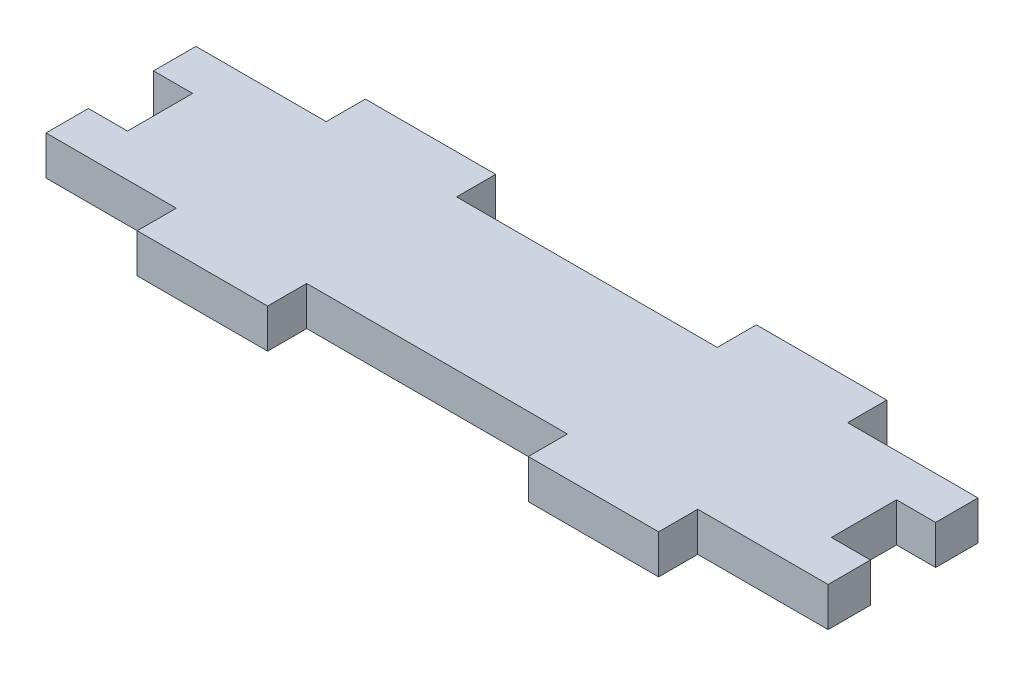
ISO-10303-21;
HEADER;
FILE_DESCRIPTION(('STEP AP214'),'2;1');
FILE_NAME('part.step','',(''),(''),'','','');
FILE_SCHEMA(('AUTOMOTIVE_DESIGN { 1 0 10303 214 1 1 1 1 }'));
ENDSEC;
DATA;
#1=APPLICATION_CONTEXT('core data for automotive mechanical design processes');
#2=APPLICATION_PROTOCOL_DEFINITION('international standard','automotive_design',2000,#1);
#3=PRODUCT_CONTEXT('',#1,'mechanical');
#4=PRODUCT('Part','Part','',(#3));
#5=PRODUCT_RELATED_PRODUCT_CATEGORY('part','',(#4));
#6=PRODUCT_DEFINITION_FORMATION('','',#4);
#7=PRODUCT_DEFINITION_CONTEXT('part definition',#1,'design');
#8=PRODUCT_DEFINITION('design','',#6,#7);
#9=PRODUCT_DEFINITION_SHAPE('','',#8);
#10=(LENGTH_UNIT() NAMED_UNIT(*) SI_UNIT(.MILLI.,.METRE.));
#11=(NAMED_UNIT(*) PLANE_ANGLE_UNIT() SI_UNIT($,.RADIAN.));
#12=(NAMED_UNIT(*) SI_UNIT($,.STERADIAN.) SOLID_ANGLE_UNIT());
#13=UNCERTAINTY_MEASURE_WITH_UNIT(LENGTH_MEASURE(1.E-05),#10,'distance_accuracy_value','');
#14=(GEOMETRIC_REPRESENTATION_CONTEXT(3) GLOBAL_UNCERTAINTY_ASSIGNED_CONTEXT((#13)) GLOBAL_UNIT_ASSIGNED_CONTEXT((#10,
#11,#12)) REPRESENTATION_CONTEXT('',''));
#15=CARTESIAN_POINT('',(0.,0.,0.));
#16=DIRECTION('',(0.,0.,1.));
#17=DIRECTION('',(1.,0.,0.));
#18=AXIS2_PLACEMENT_3D('',#15,#16,#17);
#19=CARTESIAN_POINT('',(-30.,3.,6.50000000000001));
#20=DIRECTION('',(0.,0.,-1.));
#21=DIRECTION('',(-1.,0.,0.));
#22=AXIS2_PLACEMENT_3D('',#19,#20,#21);
#23=PLANE('',#22);
#24=DIRECTION('',(1.,0.,0.));
#25=VECTOR('',#24,1.);
#26=CARTESIAN_POINT('',(-30.,3.,6.50000000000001));
#27=LINE('',#26,#25);
#28=CARTESIAN_POINT('',(9.99999999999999,3.,6.50000000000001));
#29=VERTEX_POINT('',#28);
#30=CARTESIAN_POINT('',(20.,3.,6.50000000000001));
#31=VERTEX_POINT('',#30);
#32=EDGE_CURVE('E399',#29,#31,#27,.T.);
#33=ORIENTED_EDGE('',*,*,#32,.F.);
#34=DIRECTION('',(0.,-1.,0.));
#35=VECTOR('',#34,1.);
#36=CARTESIAN_POINT('',(9.99999999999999,3.,6.50000000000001));
#37=LINE('',#36,#35);
#38=CARTESIAN_POINT('',(9.99999999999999,0.,6.50000000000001));
#39=VERTEX_POINT('',#38);
#40=EDGE_CURVE('E270',#29,#39,#37,.T.);
#41=ORIENTED_EDGE('',*,*,#40,.T.);
#42=DIRECTION('',(1.,0.,0.));
#43=VECTOR('',#42,1.);
#44=CARTESIAN_POINT('',(-30.,0.,6.50000000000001));
#45=LINE('',#44,#43);
#46=CARTESIAN_POINT('',(20.,0.,6.50000000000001));
#47=VERTEX_POINT('',#46);
#48=EDGE_CURVE('E412',#39,#47,#45,.T.);
#49=ORIENTED_EDGE('',*,*,#48,.T.);
#50=DIRECTION('',(0.,-1.,0.));
#51=VECTOR('',#50,1.);
#52=CARTESIAN_POINT('',(20.,3.,6.50000000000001));
#53=LINE('',#52,#51);
#54=EDGE_CURVE('E273',#31,#47,#53,.T.);
#55=ORIENTED_EDGE('',*,*,#54,.F.);
#56=EDGE_LOOP('',(#33,#41,#49,#55));
#57=FACE_BOUND('',#56,.T.);
#58=ADVANCED_FACE('F35',(#57),#23,.F.);
#59=CARTESIAN_POINT('',(-30.,3.,-11.));
#60=DIRECTION('',(0.,0.,1.));
#61=DIRECTION('',(1.,0.,0.));
#62=AXIS2_PLACEMENT_3D('',#59,#60,#61);
#63=PLANE('',#62);
#64=DIRECTION('',(-1.,0.,0.));
#65=VECTOR('',#64,1.);
#66=CARTESIAN_POINT('',(-30.,3.,-11.));
#67=LINE('',#66,#65);
#68=CARTESIAN_POINT('',(20.,3.,-11.));
#69=VERTEX_POINT('',#68);
#70=CARTESIAN_POINT('',(9.99999999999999,3.,-11.));
#71=VERTEX_POINT('',#70);
#72=EDGE_CURVE('E409',#69,#71,#67,.T.);
#73=ORIENTED_EDGE('',*,*,#72,.F.);
#74=DIRECTION('',(0.,-1.,0.));
#75=VECTOR('',#74,1.);
#76=CARTESIAN_POINT('',(20.,3.,-11.));
#77=LINE('',#76,#75);
#78=CARTESIAN_POINT('',(20.,0.,-11.));
#79=VERTEX_POINT('',#78);
#80=EDGE_CURVE('E244',#69,#79,#77,.T.);
#81=ORIENTED_EDGE('',*,*,#80,.T.);
#82=DIRECTION('',(-1.,0.,0.));
#83=VECTOR('',#82,1.);
#84=CARTESIAN_POINT('',(-30.,0.,-11.));
#85=LINE('',#84,#83);
#86=CARTESIAN_POINT('',(9.99999999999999,0.,-11.));
#87=VERTEX_POINT('',#86);
#88=EDGE_CURVE('E422',#79,#87,#85,.T.);
#89=ORIENTED_EDGE('',*,*,#88,.T.);
#90=DIRECTION('',(0.,-1.,0.));
#91=VECTOR('',#90,1.);
#92=CARTESIAN_POINT('',(9.99999999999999,3.,-11.));
#93=LINE('',#92,#91);
#94=EDGE_CURVE('E254',#71,#87,#93,.T.);
#95=ORIENTED_EDGE('',*,*,#94,.F.);
#96=EDGE_LOOP('',(#73,#81,#89,#95));
#97=FACE_BOUND('',#96,.T.);
#98=ADVANCED_FACE('F529',(#97),#63,.F.);
#99=CARTESIAN_POINT('',(30.,3.,6.50000000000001));
#100=DIRECTION('',(-1.,0.,0.));
#101=DIRECTION('',(0.,0.,1.));
#102=AXIS2_PLACEMENT_3D('',#99,#100,#101);
#103=PLANE('',#102);
#104=DIRECTION('',(0.,0.,-1.));
#105=VECTOR('',#104,1.);
#106=CARTESIAN_POINT('',(30.,0.,6.50000000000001));
#107=LINE('',#106,#105);
#108=CARTESIAN_POINT('',(30.,0.,-4.75));
#109=VERTEX_POINT('',#108);
#110=CARTESIAN_POINT('',(30.,0.,-7.99999999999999));
#111=VERTEX_POINT('',#110);
#112=EDGE_CURVE('E419',#109,#111,#107,.T.);
#113=ORIENTED_EDGE('',*,*,#112,.T.);
#114=DIRECTION('',(0.,-1.,0.));
#115=VECTOR('',#114,1.);
#116=CARTESIAN_POINT('',(30.,3.,-7.99999999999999));
#117=LINE('',#116,#115);
#118=CARTESIAN_POINT('',(30.,3.,-7.99999999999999));
#119=VERTEX_POINT('',#118);
#120=EDGE_CURVE('E263',#119,#111,#117,.T.);
#121=ORIENTED_EDGE('',*,*,#120,.F.);
#122=DIRECTION('',(0.,0.,-1.));
#123=VECTOR('',#122,1.);
#124=CARTESIAN_POINT('',(30.,3.,6.50000000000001));
#125=LINE('',#124,#123);
#126=CARTESIAN_POINT('',(30.,3.,-4.75));
#127=VERTEX_POINT('',#126);
#128=EDGE_CURVE('E407',#127,#119,#125,.T.);
#129=ORIENTED_EDGE('',*,*,#128,.F.);
#130=DIRECTION('',(0.,1.,0.));
#131=VECTOR('',#130,1.);
#132=CARTESIAN_POINT('',(30.,-5.8309518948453,-4.75));
#133=LINE('',#132,#131);
#134=EDGE_CURVE('E357',#109,#127,#133,.T.);
#135=ORIENTED_EDGE('',*,*,#134,.F.);
#136=EDGE_LOOP('',(#113,#121,#129,#135));
#137=FACE_BOUND('',#136,.T.);
#138=ADVANCED_FACE('F475',(#137),#103,.F.);
#139=CARTESIAN_POINT('',(30.,3.,3.5));
#140=VERTEX_POINT('',#139);
#141=CARTESIAN_POINT('',(30.,3.,0.250000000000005));
#142=VERTEX_POINT('',#141);
#143=EDGE_CURVE('E404',#140,#142,#125,.T.);
#144=ORIENTED_EDGE('',*,*,#143,.F.);
#145=DIRECTION('',(0.,-1.,0.));
#146=VECTOR('',#145,1.);
#147=CARTESIAN_POINT('',(30.,3.,3.5));
#148=LINE('',#147,#146);
#149=CARTESIAN_POINT('',(30.,0.,3.5));
#150=VERTEX_POINT('',#149);
#151=EDGE_CURVE('E261',#140,#150,#148,.T.);
#152=ORIENTED_EDGE('',*,*,#151,.T.);
#153=CARTESIAN_POINT('',(30.,0.,0.250000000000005));
#154=VERTEX_POINT('',#153);
#155=EDGE_CURVE('E416',#150,#154,#107,.T.);
#156=ORIENTED_EDGE('',*,*,#155,.T.);
#157=DIRECTION('',(0.,1.,0.));
#158=VECTOR('',#157,1.);
#159=CARTESIAN_POINT('',(30.,-5.8309518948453,0.250000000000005));
#160=LINE('',#159,#158);
#161=EDGE_CURVE('E349',#154,#142,#160,.T.);
#162=ORIENTED_EDGE('',*,*,#161,.T.);
#163=EDGE_LOOP('',(#144,#152,#156,#162));
#164=FACE_BOUND('',#163,.T.);
#165=ADVANCED_FACE('F434',(#164),#103,.F.);
#166=CARTESIAN_POINT('',(0.,3.,0.));
#167=DIRECTION('',(0.,-1.,0.));
#168=DIRECTION('',(0.,0.,-1.));
#169=AXIS2_PLACEMENT_3D('',#166,#167,#168);
#170=PLANE('',#169);
#171=DIRECTION('',(0.,0.,1.));
#172=VECTOR('',#171,1.);
#173=CARTESIAN_POINT('',(-30.,3.,6.50000000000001));
#174=LINE('',#173,#172);
#175=CARTESIAN_POINT('',(-30.,3.,0.250000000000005));
#176=VERTEX_POINT('',#175);
#177=CARTESIAN_POINT('',(-30.,3.,3.5));
#178=VERTEX_POINT('',#177);
#179=EDGE_CURVE('E400',#176,#178,#174,.T.);
#180=ORIENTED_EDGE('',*,*,#179,.T.);
#181=DIRECTION('',(1.,0.,0.));
#182=VECTOR('',#181,1.);
#183=CARTESIAN_POINT('',(-30.,3.,3.5));
#184=LINE('',#183,#182);
#185=CARTESIAN_POINT('',(-20.,3.,3.5));
#186=VERTEX_POINT('',#185);
#187=EDGE_CURVE('E298',#178,#186,#184,.T.);
#188=ORIENTED_EDGE('',*,*,#187,.T.);
#189=DIRECTION('',(0.,0.,1.));
#190=VECTOR('',#189,1.);
#191=CARTESIAN_POINT('',(-20.,3.,3.5));
#192=LINE('',#191,#190);
#193=CARTESIAN_POINT('',(-20.,3.,6.50000000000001));
#194=VERTEX_POINT('',#193);
#195=EDGE_CURVE('E301',#186,#194,#192,.T.);
#196=ORIENTED_EDGE('',*,*,#195,.T.);
#197=CARTESIAN_POINT('',(-9.99999999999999,3.,6.50000000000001));
#198=VERTEX_POINT('',#197);
#199=EDGE_CURVE('E403',#194,#198,#27,.T.);
#200=ORIENTED_EDGE('',*,*,#199,.T.);
#201=DIRECTION('',(0.,0.,-1.));
#202=VECTOR('',#201,1.);
#203=CARTESIAN_POINT('',(-9.99999999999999,3.,6.50000000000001));
#204=LINE('',#203,#202);
#205=CARTESIAN_POINT('',(-9.99999999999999,3.,3.5));
#206=VERTEX_POINT('',#205);
#207=EDGE_CURVE('E58',#198,#206,#204,.T.);
#208=ORIENTED_EDGE('',*,*,#207,.T.);
#209=DIRECTION('',(1.,0.,0.));
#210=VECTOR('',#209,1.);
#211=CARTESIAN_POINT('',(-9.99999999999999,3.,3.5));
#212=LINE('',#211,#210);
#213=CARTESIAN_POINT('',(9.99999999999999,3.,3.5));
#214=VERTEX_POINT('',#213);
#215=EDGE_CURVE('E281',#206,#214,#212,.T.);
#216=ORIENTED_EDGE('',*,*,#215,.T.);
#217=DIRECTION('',(0.,0.,1.));
#218=VECTOR('',#217,1.);
#219=CARTESIAN_POINT('',(9.99999999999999,3.,3.5));
#220=LINE('',#219,#218);
#221=EDGE_CURVE('E285',#214,#29,#220,.T.);
#222=ORIENTED_EDGE('',*,*,#221,.T.);
#223=ORIENTED_EDGE('',*,*,#32,.T.);
#224=DIRECTION('',(0.,0.,-1.));
#225=VECTOR('',#224,1.);
#226=CARTESIAN_POINT('',(20.,3.,6.50000000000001));
#227=LINE('',#226,#225);
#228=CARTESIAN_POINT('',(20.,3.,3.5));
#229=VERTEX_POINT('',#228);
#230=EDGE_CURVE('E50',#31,#229,#227,.T.);
#231=ORIENTED_EDGE('',*,*,#230,.T.);
#232=DIRECTION('',(1.,0.,0.));
#233=VECTOR('',#232,1.);
#234=CARTESIAN_POINT('',(20.,3.,3.5));
#235=LINE('',#234,#233);
#236=EDGE_CURVE('E269',#229,#140,#235,.T.);
#237=ORIENTED_EDGE('',*,*,#236,.T.);
#238=ORIENTED_EDGE('',*,*,#143,.T.);
#239=DIRECTION('',(-1.,0.,0.));
#240=VECTOR('',#239,1.);
#241=CARTESIAN_POINT('',(30.,3.,0.250000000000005));
#242=LINE('',#241,#240);
#243=CARTESIAN_POINT('',(27.,3.,0.250000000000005));
#244=VERTEX_POINT('',#243);
#245=EDGE_CURVE('E345',#142,#244,#242,.T.);
#246=ORIENTED_EDGE('',*,*,#245,.T.);
#247=DIRECTION('',(0.,0.,-1.));
#248=VECTOR('',#247,1.);
#249=CARTESIAN_POINT('',(27.,3.,-4.75));
#250=LINE('',#249,#248);
#251=CARTESIAN_POINT('',(27.,3.,-4.75));
#252=VERTEX_POINT('',#251);
#253=EDGE_CURVE('E350',#244,#252,#250,.T.);
#254=ORIENTED_EDGE('',*,*,#253,.T.);
#255=DIRECTION('',(1.,0.,0.));
#256=VECTOR('',#255,1.);
#257=CARTESIAN_POINT('',(30.,3.,-4.75));
#258=LINE('',#257,#256);
#259=EDGE_CURVE('E354',#252,#127,#258,.T.);
#260=ORIENTED_EDGE('',*,*,#259,.T.);
#261=ORIENTED_EDGE('',*,*,#128,.T.);
#262=DIRECTION('',(-1.,0.,0.));
#263=VECTOR('',#262,1.);
#264=CARTESIAN_POINT('',(30.,3.,-7.99999999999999));
#265=LINE('',#264,#263);
#266=CARTESIAN_POINT('',(20.,3.,-7.99999999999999));
#267=VERTEX_POINT('',#266);
#268=EDGE_CURVE('E257',#119,#267,#265,.T.);
#269=ORIENTED_EDGE('',*,*,#268,.T.);
#270=DIRECTION('',(0.,0.,-1.));
#271=VECTOR('',#270,1.);
#272=CARTESIAN_POINT('',(20.,3.,-7.99999999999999));
#273=LINE('',#272,#271);
#274=EDGE_CURVE('E260',#267,#69,#273,.T.);
#275=ORIENTED_EDGE('',*,*,#274,.T.);
#276=ORIENTED_EDGE('',*,*,#72,.T.);
#277=DIRECTION('',(0.,0.,1.));
#278=VECTOR('',#277,1.);
#279=CARTESIAN_POINT('',(9.99999999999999,3.,-11.));
#280=LINE('',#279,#278);
#281=CARTESIAN_POINT('',(9.99999999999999,3.,-7.99999999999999));
#282=VERTEX_POINT('',#281);
#283=EDGE_CURVE('E231',#71,#282,#280,.T.);
#284=ORIENTED_EDGE('',*,*,#283,.T.);
#285=DIRECTION('',(-1.,0.,0.));
#286=VECTOR('',#285,1.);
#287=CARTESIAN_POINT('',(9.99999999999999,3.,-7.99999999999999));
#288=LINE('',#287,#286);
#289=CARTESIAN_POINT('',(-9.99999999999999,3.,-7.99999999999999));
#290=VERTEX_POINT('',#289);
#291=EDGE_CURVE('E224',#282,#290,#288,.T.);
#292=ORIENTED_EDGE('',*,*,#291,.T.);
#293=DIRECTION('',(0.,0.,-1.));
#294=VECTOR('',#293,1.);
#295=CARTESIAN_POINT('',(-9.99999999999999,3.,-7.99999999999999));
#296=LINE('',#295,#294);
#297=CARTESIAN_POINT('',(-9.99999999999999,3.,-11.));
#298=VERTEX_POINT('',#297);
#299=EDGE_CURVE('E234',#290,#298,#296,.T.);
#300=ORIENTED_EDGE('',*,*,#299,.T.);
#301=CARTESIAN_POINT('',(-20.,3.,-11.));
#302=VERTEX_POINT('',#301);
#303=EDGE_CURVE('E406',#298,#302,#67,.T.);
#304=ORIENTED_EDGE('',*,*,#303,.T.);
#305=DIRECTION('',(0.,0.,1.));
#306=VECTOR('',#305,1.);
#307=CARTESIAN_POINT('',(-20.,3.,-11.));
#308=LINE('',#307,#306);
#309=CARTESIAN_POINT('',(-20.,3.,-7.99999999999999));
#310=VERTEX_POINT('',#309);
#311=EDGE_CURVE('E253',#302,#310,#308,.T.);
#312=ORIENTED_EDGE('',*,*,#311,.T.);
#313=DIRECTION('',(-1.,0.,0.));
#314=VECTOR('',#313,1.);
#315=CARTESIAN_POINT('',(-20.,3.,-7.99999999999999));
#316=LINE('',#315,#314);
#317=CARTESIAN_POINT('',(-30.,3.,-7.99999999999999));
#318=VERTEX_POINT('',#317);
#319=EDGE_CURVE('E313',#310,#318,#316,.T.);
#320=ORIENTED_EDGE('',*,*,#319,.T.);
#321=CARTESIAN_POINT('',(-30.,3.,-4.75));
#322=VERTEX_POINT('',#321);
#323=EDGE_CURVE('E397',#318,#322,#174,.T.);
#324=ORIENTED_EDGE('',*,*,#323,.T.);
#325=DIRECTION('',(-1.,0.,0.));
#326=VECTOR('',#325,1.);
#327=CARTESIAN_POINT('',(-30.,3.,-4.75));
#328=LINE('',#327,#326);
#329=CARTESIAN_POINT('',(-27.,3.,-4.75));
#330=VERTEX_POINT('',#329);
#331=EDGE_CURVE('E360',#330,#322,#328,.T.);
#332=ORIENTED_EDGE('',*,*,#331,.F.);
#333=DIRECTION('',(0.,0.,-1.));
#334=VECTOR('',#333,1.);
#335=CARTESIAN_POINT('',(-27.,3.,-4.75));
#336=LINE('',#335,#334);
#337=CARTESIAN_POINT('',(-27.,3.,0.250000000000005));
#338=VERTEX_POINT('',#337);
#339=EDGE_CURVE('E370',#338,#330,#336,.T.);
#340=ORIENTED_EDGE('',*,*,#339,.F.);
#341=DIRECTION('',(1.,0.,0.));
#342=VECTOR('',#341,1.);
#343=CARTESIAN_POINT('',(-30.,3.,0.250000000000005));
#344=LINE('',#343,#342);
#345=EDGE_CURVE('E374',#176,#338,#344,.T.);
#346=ORIENTED_EDGE('',*,*,#345,.F.);
#347=EDGE_LOOP('',(#180,#188,#196,#200,#208,#216,#222,#223,#231,#237,#238,#246,#254,#260,#261,
#269,#275,#276,#284,#292,#300,#304,#312,#320,#324,#332,#340,#346));
#348=FACE_BOUND('',#347,.T.);
#349=ADVANCED_FACE('F242',(#348),#170,.F.);
#350=CARTESIAN_POINT('',(0.,0.,0.));
#351=DIRECTION('',(0.,-1.,0.));
#352=DIRECTION('',(0.,0.,-1.));
#353=AXIS2_PLACEMENT_3D('',#350,#351,#352);
#354=PLANE('',#353);
#355=DIRECTION('',(1.,0.,0.));
#356=VECTOR('',#355,1.);
#357=CARTESIAN_POINT('',(0.,0.,3.5));
#358=LINE('',#357,#356);
#359=CARTESIAN_POINT('',(-30.,0.,3.5));
#360=VERTEX_POINT('',#359);
#361=CARTESIAN_POINT('',(-20.,0.,3.5));
#362=VERTEX_POINT('',#361);
#363=EDGE_CURVE('E342',#360,#362,#358,.T.);
#364=ORIENTED_EDGE('',*,*,#363,.F.);
#365=DIRECTION('',(0.,0.,1.));
#366=VECTOR('',#365,1.);
#367=CARTESIAN_POINT('',(-30.,0.,6.50000000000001));
#368=LINE('',#367,#366);
#369=CARTESIAN_POINT('',(-30.,0.,0.250000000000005));
#370=VERTEX_POINT('',#369);
#371=EDGE_CURVE('E396',#370,#360,#368,.T.);
#372=ORIENTED_EDGE('',*,*,#371,.F.);
#373=DIRECTION('',(1.,0.,0.));
#374=VECTOR('',#373,1.);
#375=CARTESIAN_POINT('',(-30.,0.,0.250000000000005));
#376=LINE('',#375,#374);
#377=CARTESIAN_POINT('',(-27.,0.,0.250000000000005));
#378=VERTEX_POINT('',#377);
#379=EDGE_CURVE('E388',#370,#378,#376,.T.);
#380=ORIENTED_EDGE('',*,*,#379,.T.);
#381=DIRECTION('',(0.,0.,-1.));
#382=VECTOR('',#381,1.);
#383=CARTESIAN_POINT('',(-27.,0.,-4.75));
#384=LINE('',#383,#382);
#385=CARTESIAN_POINT('',(-27.,0.,-4.75));
#386=VERTEX_POINT('',#385);
#387=EDGE_CURVE('E384',#378,#386,#384,.T.);
#388=ORIENTED_EDGE('',*,*,#387,.T.);
#389=DIRECTION('',(-1.,0.,0.));
#390=VECTOR('',#389,1.);
#391=CARTESIAN_POINT('',(-30.,0.,-4.75));
#392=LINE('',#391,#390);
#393=CARTESIAN_POINT('',(-30.,0.,-4.75));
#394=VERTEX_POINT('',#393);
#395=EDGE_CURVE('E379',#386,#394,#392,.T.);
#396=ORIENTED_EDGE('',*,*,#395,.T.);
#397=CARTESIAN_POINT('',(-30.,0.,-7.99999999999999));
#398=VERTEX_POINT('',#397);
#399=EDGE_CURVE('E410',#398,#394,#368,.T.);
#400=ORIENTED_EDGE('',*,*,#399,.F.);
#401=DIRECTION('',(-1.,0.,0.));
#402=VECTOR('',#401,1.);
#403=CARTESIAN_POINT('',(0.,0.,-7.99999999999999));
#404=LINE('',#403,#402);
#405=CARTESIAN_POINT('',(-20.,0.,-7.99999999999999));
#406=VERTEX_POINT('',#405);
#407=EDGE_CURVE('E340',#406,#398,#404,.T.);
#408=ORIENTED_EDGE('',*,*,#407,.F.);
#409=DIRECTION('',(0.,0.,1.));
#410=VECTOR('',#409,1.);
#411=CARTESIAN_POINT('',(-20.,0.,0.));
#412=LINE('',#411,#410);
#413=CARTESIAN_POINT('',(-20.,0.,-11.));
#414=VERTEX_POINT('',#413);
#415=EDGE_CURVE('E320',#414,#406,#412,.T.);
#416=ORIENTED_EDGE('',*,*,#415,.F.);
#417=CARTESIAN_POINT('',(-9.99999999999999,0.,-11.));
#418=VERTEX_POINT('',#417);
#419=EDGE_CURVE('E418',#418,#414,#85,.T.);
#420=ORIENTED_EDGE('',*,*,#419,.F.);
#421=DIRECTION('',(0.,0.,-1.));
#422=VECTOR('',#421,1.);
#423=CARTESIAN_POINT('',(-9.99999999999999,0.,0.));
#424=LINE('',#423,#422);
#425=CARTESIAN_POINT('',(-9.99999999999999,0.,-7.99999999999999));
#426=VERTEX_POINT('',#425);
#427=EDGE_CURVE('E326',#426,#418,#424,.T.);
#428=ORIENTED_EDGE('',*,*,#427,.F.);
#429=DIRECTION('',(-1.,0.,0.));
#430=VECTOR('',#429,1.);
#431=CARTESIAN_POINT('',(0.,0.,-7.99999999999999));
#432=LINE('',#431,#430);
#433=CARTESIAN_POINT('',(9.99999999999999,0.,-7.99999999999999));
#434=VERTEX_POINT('',#433);
#435=EDGE_CURVE('E227',#434,#426,#432,.T.);
#436=ORIENTED_EDGE('',*,*,#435,.F.);
#437=DIRECTION('',(0.,0.,1.));
#438=VECTOR('',#437,1.);
#439=CARTESIAN_POINT('',(9.99999999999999,0.,0.));
#440=LINE('',#439,#438);
#441=EDGE_CURVE('E328',#87,#434,#440,.T.);
#442=ORIENTED_EDGE('',*,*,#441,.F.);
#443=ORIENTED_EDGE('',*,*,#88,.F.);
#444=DIRECTION('',(0.,0.,-1.));
#445=VECTOR('',#444,1.);
#446=CARTESIAN_POINT('',(20.,0.,0.));
#447=LINE('',#446,#445);
#448=CARTESIAN_POINT('',(20.,0.,-7.99999999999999));
#449=VERTEX_POINT('',#448);
#450=EDGE_CURVE('E330',#449,#79,#447,.T.);
#451=ORIENTED_EDGE('',*,*,#450,.F.);
#452=DIRECTION('',(-1.,0.,0.));
#453=VECTOR('',#452,1.);
#454=CARTESIAN_POINT('',(0.,0.,-7.99999999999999));
#455=LINE('',#454,#453);
#456=EDGE_CURVE('E424',#111,#449,#455,.T.);
#457=ORIENTED_EDGE('',*,*,#456,.F.);
#458=ORIENTED_EDGE('',*,*,#112,.F.);
#459=DIRECTION('',(1.,0.,0.));
#460=VECTOR('',#459,1.);
#461=CARTESIAN_POINT('',(30.,0.,-4.75));
#462=LINE('',#461,#460);
#463=CARTESIAN_POINT('',(27.,0.,-4.75));
#464=VERTEX_POINT('',#463);
#465=EDGE_CURVE('E361',#464,#109,#462,.T.);
#466=ORIENTED_EDGE('',*,*,#465,.F.);
#467=DIRECTION('',(0.,0.,-1.));
#468=VECTOR('',#467,1.);
#469=CARTESIAN_POINT('',(27.,0.,-4.75));
#470=LINE('',#469,#468);
#471=CARTESIAN_POINT('',(27.,0.,0.250000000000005));
#472=VERTEX_POINT('',#471);
#473=EDGE_CURVE('E353',#472,#464,#470,.T.);
#474=ORIENTED_EDGE('',*,*,#473,.F.);
#475=DIRECTION('',(-1.,0.,0.));
#476=VECTOR('',#475,1.);
#477=CARTESIAN_POINT('',(30.,0.,0.250000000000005));
#478=LINE('',#477,#476);
#479=EDGE_CURVE('E358',#154,#472,#478,.T.);
#480=ORIENTED_EDGE('',*,*,#479,.F.);
#481=ORIENTED_EDGE('',*,*,#155,.F.);
#482=DIRECTION('',(1.,0.,0.));
#483=VECTOR('',#482,1.);
#484=CARTESIAN_POINT('',(0.,0.,3.5));
#485=LINE('',#484,#483);
#486=CARTESIAN_POINT('',(20.,0.,3.5));
#487=VERTEX_POINT('',#486);
#488=EDGE_CURVE('E43',#487,#150,#485,.T.);
#489=ORIENTED_EDGE('',*,*,#488,.F.);
#490=DIRECTION('',(0.,0.,-1.));
#491=VECTOR('',#490,1.);
#492=CARTESIAN_POINT('',(20.,0.,0.));
#493=LINE('',#492,#491);
#494=EDGE_CURVE('E332',#47,#487,#493,.T.);
#495=ORIENTED_EDGE('',*,*,#494,.F.);
#496=ORIENTED_EDGE('',*,*,#48,.F.);
#497=DIRECTION('',(0.,0.,1.));
#498=VECTOR('',#497,1.);
#499=CARTESIAN_POINT('',(9.99999999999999,0.,0.));
#500=LINE('',#499,#498);
#501=CARTESIAN_POINT('',(9.99999999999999,0.,3.5));
#502=VERTEX_POINT('',#501);
#503=EDGE_CURVE('E336',#502,#39,#500,.T.);
#504=ORIENTED_EDGE('',*,*,#503,.F.);
#505=DIRECTION('',(1.,0.,0.));
#506=VECTOR('',#505,1.);
#507=CARTESIAN_POINT('',(0.,0.,3.5));
#508=LINE('',#507,#506);
#509=CARTESIAN_POINT('',(-9.99999999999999,0.,3.5));
#510=VERTEX_POINT('',#509);
#511=EDGE_CURVE('E11',#510,#502,#508,.T.);
#512=ORIENTED_EDGE('',*,*,#511,.F.);
#513=DIRECTION('',(0.,0.,-1.));
#514=VECTOR('',#513,1.);
#515=CARTESIAN_POINT('',(-9.99999999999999,0.,0.));
#516=LINE('',#515,#514);
#517=CARTESIAN_POINT('',(-9.99999999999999,0.,6.50000000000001));
#518=VERTEX_POINT('',#517);
#519=EDGE_CURVE('E334',#518,#510,#516,.T.);
#520=ORIENTED_EDGE('',*,*,#519,.F.);
#521=CARTESIAN_POINT('',(-20.,0.,6.50000000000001));
#522=VERTEX_POINT('',#521);
#523=EDGE_CURVE('E415',#522,#518,#45,.T.);
#524=ORIENTED_EDGE('',*,*,#523,.F.);
#525=DIRECTION('',(0.,0.,1.));
#526=VECTOR('',#525,1.);
#527=CARTESIAN_POINT('',(-20.,0.,0.));
#528=LINE('',#527,#526);
#529=EDGE_CURVE('E338',#362,#522,#528,.T.);
#530=ORIENTED_EDGE('',*,*,#529,.F.);
#531=EDGE_LOOP('',(#364,#372,#380,#388,#396,#400,#408,#416,#420,#428,#436,#442,#443,#451,#457,
#458,#466,#474,#480,#481,#489,#495,#496,#504,#512,#520,#524,#530));
#532=FACE_BOUND('',#531,.T.);
#533=ADVANCED_FACE('F438',(#532),#354,.T.);
#534=CARTESIAN_POINT('',(-30.,3.,6.50000000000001));
#535=DIRECTION('',(1.,0.,0.));
#536=DIRECTION('',(0.,0.,-1.));
#537=AXIS2_PLACEMENT_3D('',#534,#535,#536);
#538=PLANE('',#537);
#539=ORIENTED_EDGE('',*,*,#371,.T.);
#540=DIRECTION('',(0.,-1.,0.));
#541=VECTOR('',#540,1.);
#542=CARTESIAN_POINT('',(-30.,3.,3.5));
#543=LINE('',#542,#541);
#544=EDGE_CURVE('E282',#178,#360,#543,.T.);
#545=ORIENTED_EDGE('',*,*,#544,.F.);
#546=ORIENTED_EDGE('',*,*,#179,.F.);
#547=DIRECTION('',(0.,1.,0.));
#548=VECTOR('',#547,1.);
#549=CARTESIAN_POINT('',(-30.,-5.8309518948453,0.250000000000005));
#550=LINE('',#549,#548);
#551=EDGE_CURVE('E373',#370,#176,#550,.T.);
#552=ORIENTED_EDGE('',*,*,#551,.F.);
#553=EDGE_LOOP('',(#539,#545,#546,#552));
#554=FACE_BOUND('',#553,.T.);
#555=ADVANCED_FACE('F496',(#554),#538,.F.);
#556=ORIENTED_EDGE('',*,*,#323,.F.);
#557=DIRECTION('',(0.,-1.,0.));
#558=VECTOR('',#557,1.);
#559=CARTESIAN_POINT('',(-30.,3.,-7.99999999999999));
#560=LINE('',#559,#558);
#561=EDGE_CURVE('E317',#318,#398,#560,.T.);
#562=ORIENTED_EDGE('',*,*,#561,.T.);
#563=ORIENTED_EDGE('',*,*,#399,.T.);
#564=DIRECTION('',(0.,1.,0.));
#565=VECTOR('',#564,1.);
#566=CARTESIAN_POINT('',(-30.,-5.8309518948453,-4.75));
#567=LINE('',#566,#565);
#568=EDGE_CURVE('E382',#394,#322,#567,.T.);
#569=ORIENTED_EDGE('',*,*,#568,.T.);
#570=EDGE_LOOP('',(#556,#562,#563,#569));
#571=FACE_BOUND('',#570,.T.);
#572=ADVANCED_FACE('F37',(#571),#538,.F.);
#573=ORIENTED_EDGE('',*,*,#199,.F.);
#574=DIRECTION('',(0.,-1.,0.));
#575=VECTOR('',#574,1.);
#576=CARTESIAN_POINT('',(-20.,3.,6.50000000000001));
#577=LINE('',#576,#575);
#578=EDGE_CURVE('E306',#194,#522,#577,.T.);
#579=ORIENTED_EDGE('',*,*,#578,.T.);
#580=ORIENTED_EDGE('',*,*,#523,.T.);
#581=DIRECTION('',(0.,-1.,0.));
#582=VECTOR('',#581,1.);
#583=CARTESIAN_POINT('',(-9.99999999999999,3.,6.50000000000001));
#584=LINE('',#583,#582);
#585=EDGE_CURVE('E288',#198,#518,#584,.T.);
#586=ORIENTED_EDGE('',*,*,#585,.F.);
#587=EDGE_LOOP('',(#573,#579,#580,#586));
#588=FACE_BOUND('',#587,.T.);
#589=ADVANCED_FACE('F468',(#588),#23,.F.);
#590=ORIENTED_EDGE('',*,*,#303,.F.);
#591=DIRECTION('',(0.,-1.,0.));
#592=VECTOR('',#591,1.);
#593=CARTESIAN_POINT('',(-9.99999999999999,3.,-11.));
#594=LINE('',#593,#592);
#595=EDGE_CURVE('E230',#298,#418,#594,.T.);
#596=ORIENTED_EDGE('',*,*,#595,.T.);
#597=ORIENTED_EDGE('',*,*,#419,.T.);
#598=DIRECTION('',(0.,-1.,0.));
#599=VECTOR('',#598,1.);
#600=CARTESIAN_POINT('',(-20.,3.,-11.));
#601=LINE('',#600,#599);
#602=EDGE_CURVE('E316',#302,#414,#601,.T.);
#603=ORIENTED_EDGE('',*,*,#602,.F.);
#604=EDGE_LOOP('',(#590,#596,#597,#603));
#605=FACE_BOUND('',#604,.T.);
#606=ADVANCED_FACE('F522',(#605),#63,.F.);
#607=CARTESIAN_POINT('',(-30.,-5.8309518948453,0.250000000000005));
#608=DIRECTION('',(0.,0.,1.));
#609=DIRECTION('',(1.,0.,0.));
#610=AXIS2_PLACEMENT_3D('',#607,#608,#609);
#611=PLANE('',#610);
#612=ORIENTED_EDGE('',*,*,#551,.T.);
#613=ORIENTED_EDGE('',*,*,#345,.T.);
#614=DIRECTION('',(0.,1.,0.));
#615=VECTOR('',#614,1.);
#616=CARTESIAN_POINT('',(-27.,-5.8309518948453,0.250000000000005));
#617=LINE('',#616,#615);
#618=EDGE_CURVE('E387',#378,#338,#617,.T.);
#619=ORIENTED_EDGE('',*,*,#618,.F.);
#620=ORIENTED_EDGE('',*,*,#379,.F.);
#621=EDGE_LOOP('',(#612,#613,#619,#620));
#622=FACE_BOUND('',#621,.T.);
#623=ADVANCED_FACE('F500',(#622),#611,.F.);
#624=CARTESIAN_POINT('',(-27.,-5.8309518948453,-4.75));
#625=DIRECTION('',(1.,0.,0.));
#626=DIRECTION('',(0.,0.,-1.));
#627=AXIS2_PLACEMENT_3D('',#624,#625,#626);
#628=PLANE('',#627);
#629=ORIENTED_EDGE('',*,*,#618,.T.);
#630=ORIENTED_EDGE('',*,*,#339,.T.);
#631=DIRECTION('',(0.,1.,0.));
#632=VECTOR('',#631,1.);
#633=CARTESIAN_POINT('',(-27.,-5.8309518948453,-4.75));
#634=LINE('',#633,#632);
#635=EDGE_CURVE('E383',#386,#330,#634,.T.);
#636=ORIENTED_EDGE('',*,*,#635,.F.);
#637=ORIENTED_EDGE('',*,*,#387,.F.);
#638=EDGE_LOOP('',(#629,#630,#636,#637));
#639=FACE_BOUND('',#638,.T.);
#640=ADVANCED_FACE('F506',(#639),#628,.F.);
#641=CARTESIAN_POINT('',(-30.,-5.8309518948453,-4.75));
#642=DIRECTION('',(0.,0.,-1.));
#643=DIRECTION('',(-1.,0.,0.));
#644=AXIS2_PLACEMENT_3D('',#641,#642,#643);
#645=PLANE('',#644);
#646=ORIENTED_EDGE('',*,*,#635,.T.);
#647=ORIENTED_EDGE('',*,*,#331,.T.);
#648=ORIENTED_EDGE('',*,*,#568,.F.);
#649=ORIENTED_EDGE('',*,*,#395,.F.);
#650=EDGE_LOOP('',(#646,#647,#648,#649));
#651=FACE_BOUND('',#650,.T.);
#652=ADVANCED_FACE('F511',(#651),#645,.F.);
#653=CARTESIAN_POINT('',(30.,-5.8309518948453,-4.75));
#654=DIRECTION('',(0.,0.,1.));
#655=DIRECTION('',(1.,0.,0.));
#656=AXIS2_PLACEMENT_3D('',#653,#654,#655);
#657=PLANE('',#656);
#658=ORIENTED_EDGE('',*,*,#465,.T.);
#659=ORIENTED_EDGE('',*,*,#134,.T.);
#660=ORIENTED_EDGE('',*,*,#259,.F.);
#661=DIRECTION('',(0.,1.,0.));
#662=VECTOR('',#661,1.);
#663=CARTESIAN_POINT('',(27.,-5.8309518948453,-4.75));
#664=LINE('',#663,#662);
#665=EDGE_CURVE('E344',#464,#252,#664,.T.);
#666=ORIENTED_EDGE('',*,*,#665,.F.);
#667=EDGE_LOOP('',(#658,#659,#660,#666));
#668=FACE_BOUND('',#667,.T.);
#669=ADVANCED_FACE('F712',(#668),#657,.T.);
#670=CARTESIAN_POINT('',(30.,-5.8309518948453,0.250000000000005));
#671=DIRECTION('',(0.,0.,-1.));
#672=DIRECTION('',(-1.,0.,0.));
#673=AXIS2_PLACEMENT_3D('',#670,#671,#672);
#674=PLANE('',#673);
#675=ORIENTED_EDGE('',*,*,#479,.T.);
#676=DIRECTION('',(0.,1.,0.));
#677=VECTOR('',#676,1.);
#678=CARTESIAN_POINT('',(27.,-5.8309518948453,0.250000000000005));
#679=LINE('',#678,#677);
#680=EDGE_CURVE('E348',#472,#244,#679,.T.);
#681=ORIENTED_EDGE('',*,*,#680,.T.);
#682=ORIENTED_EDGE('',*,*,#245,.F.);
#683=ORIENTED_EDGE('',*,*,#161,.F.);
#684=EDGE_LOOP('',(#675,#681,#682,#683));
#685=FACE_BOUND('',#684,.T.);
#686=ADVANCED_FACE('F443',(#685),#674,.T.);
#687=CARTESIAN_POINT('',(27.,-5.8309518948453,-4.75));
#688=DIRECTION('',(1.,0.,0.));
#689=DIRECTION('',(0.,0.,-1.));
#690=AXIS2_PLACEMENT_3D('',#687,#688,#689);
#691=PLANE('',#690);
#692=ORIENTED_EDGE('',*,*,#473,.T.);
#693=ORIENTED_EDGE('',*,*,#665,.T.);
#694=ORIENTED_EDGE('',*,*,#253,.F.);
#695=ORIENTED_EDGE('',*,*,#680,.F.);
#696=EDGE_LOOP('',(#692,#693,#694,#695));
#697=FACE_BOUND('',#696,.T.);
#698=ADVANCED_FACE('F447',(#697),#691,.T.);
#699=CARTESIAN_POINT('',(-20.,3.,-7.99999999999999));
#700=DIRECTION('',(0.,0.,1.));
#701=DIRECTION('',(1.,0.,0.));
#702=AXIS2_PLACEMENT_3D('',#699,#700,#701);
#703=PLANE('',#702);
#704=ORIENTED_EDGE('',*,*,#407,.T.);
#705=ORIENTED_EDGE('',*,*,#561,.F.);
#706=ORIENTED_EDGE('',*,*,#319,.F.);
#707=DIRECTION('',(0.,-1.,0.));
#708=VECTOR('',#707,1.);
#709=CARTESIAN_POINT('',(-20.,3.,-7.99999999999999));
#710=LINE('',#709,#708);
#711=EDGE_CURVE('E321',#310,#406,#710,.T.);
#712=ORIENTED_EDGE('',*,*,#711,.T.);
#713=EDGE_LOOP('',(#704,#705,#706,#712));
#714=FACE_BOUND('',#713,.T.);
#715=ADVANCED_FACE('F516',(#714),#703,.F.);
#716=CARTESIAN_POINT('',(-20.,3.,-11.));
#717=DIRECTION('',(1.,0.,0.));
#718=DIRECTION('',(0.,0.,-1.));
#719=AXIS2_PLACEMENT_3D('',#716,#717,#718);
#720=PLANE('',#719);
#721=ORIENTED_EDGE('',*,*,#415,.T.);
#722=ORIENTED_EDGE('',*,*,#711,.F.);
#723=ORIENTED_EDGE('',*,*,#311,.F.);
#724=ORIENTED_EDGE('',*,*,#602,.T.);
#725=EDGE_LOOP('',(#721,#722,#723,#724));
#726=FACE_BOUND('',#725,.T.);
#727=ADVANCED_FACE('F519',(#726),#720,.F.);
#728=CARTESIAN_POINT('',(9.99999999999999,3.,-7.99999999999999));
#729=DIRECTION('',(0.,0.,1.));
#730=DIRECTION('',(1.,0.,0.));
#731=AXIS2_PLACEMENT_3D('',#728,#729,#730);
#732=PLANE('',#731);
#733=ORIENTED_EDGE('',*,*,#435,.T.);
#734=DIRECTION('',(0.,-1.,0.));
#735=VECTOR('',#734,1.);
#736=CARTESIAN_POINT('',(-9.99999999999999,3.,-7.99999999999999));
#737=LINE('',#736,#735);
#738=EDGE_CURVE('E219',#290,#426,#737,.T.);
#739=ORIENTED_EDGE('',*,*,#738,.F.);
#740=ORIENTED_EDGE('',*,*,#291,.F.);
#741=DIRECTION('',(0.,-1.,0.));
#742=VECTOR('',#741,1.);
#743=CARTESIAN_POINT('',(9.99999999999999,3.,-7.99999999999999));
#744=LINE('',#743,#742);
#745=EDGE_CURVE('E251',#282,#434,#744,.T.);
#746=ORIENTED_EDGE('',*,*,#745,.T.);
#747=EDGE_LOOP('',(#733,#739,#740,#746));
#748=FACE_BOUND('',#747,.T.);
#749=ADVANCED_FACE('F221',(#748),#732,.F.);
#750=CARTESIAN_POINT('',(9.99999999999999,3.,-11.));
#751=DIRECTION('',(1.,0.,0.));
#752=DIRECTION('',(0.,0.,-1.));
#753=AXIS2_PLACEMENT_3D('',#750,#751,#752);
#754=PLANE('',#753);
#755=ORIENTED_EDGE('',*,*,#441,.T.);
#756=ORIENTED_EDGE('',*,*,#745,.F.);
#757=ORIENTED_EDGE('',*,*,#283,.F.);
#758=ORIENTED_EDGE('',*,*,#94,.T.);
#759=EDGE_LOOP('',(#755,#756,#757,#758));
#760=FACE_BOUND('',#759,.T.);
#761=ADVANCED_FACE('F530',(#760),#754,.F.);
#762=CARTESIAN_POINT('',(-9.99999999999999,3.,-7.99999999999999));
#763=DIRECTION('',(-1.,0.,0.));
#764=DIRECTION('',(0.,0.,1.));
#765=AXIS2_PLACEMENT_3D('',#762,#763,#764);
#766=PLANE('',#765);
#767=ORIENTED_EDGE('',*,*,#427,.T.);
#768=ORIENTED_EDGE('',*,*,#595,.F.);
#769=ORIENTED_EDGE('',*,*,#299,.F.);
#770=ORIENTED_EDGE('',*,*,#738,.T.);
#771=EDGE_LOOP('',(#767,#768,#769,#770));
#772=FACE_BOUND('',#771,.T.);
#773=ADVANCED_FACE('F235',(#772),#766,.F.);
#774=CARTESIAN_POINT('',(20.,3.,-7.99999999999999));
#775=DIRECTION('',(-1.,0.,0.));
#776=DIRECTION('',(0.,0.,1.));
#777=AXIS2_PLACEMENT_3D('',#774,#775,#776);
#778=PLANE('',#777);
#779=ORIENTED_EDGE('',*,*,#450,.T.);
#780=ORIENTED_EDGE('',*,*,#80,.F.);
#781=ORIENTED_EDGE('',*,*,#274,.F.);
#782=DIRECTION('',(0.,-1.,0.));
#783=VECTOR('',#782,1.);
#784=CARTESIAN_POINT('',(20.,3.,-7.99999999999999));
#785=LINE('',#784,#783);
#786=EDGE_CURVE('E247',#267,#449,#785,.T.);
#787=ORIENTED_EDGE('',*,*,#786,.T.);
#788=EDGE_LOOP('',(#779,#780,#781,#787));
#789=FACE_BOUND('',#788,.T.);
#790=ADVANCED_FACE('F485',(#789),#778,.F.);
#791=CARTESIAN_POINT('',(30.,3.,-7.99999999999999));
#792=DIRECTION('',(0.,0.,1.));
#793=DIRECTION('',(1.,0.,0.));
#794=AXIS2_PLACEMENT_3D('',#791,#792,#793);
#795=PLANE('',#794);
#796=ORIENTED_EDGE('',*,*,#456,.T.);
#797=ORIENTED_EDGE('',*,*,#786,.F.);
#798=ORIENTED_EDGE('',*,*,#268,.F.);
#799=ORIENTED_EDGE('',*,*,#120,.T.);
#800=EDGE_LOOP('',(#796,#797,#798,#799));
#801=FACE_BOUND('',#800,.T.);
#802=ADVANCED_FACE('F482',(#801),#795,.F.);
#803=CARTESIAN_POINT('',(20.,3.,3.5));
#804=DIRECTION('',(0.,0.,-1.));
#805=DIRECTION('',(-1.,0.,0.));
#806=AXIS2_PLACEMENT_3D('',#803,#804,#805);
#807=PLANE('',#806);
#808=ORIENTED_EDGE('',*,*,#488,.T.);
#809=ORIENTED_EDGE('',*,*,#151,.F.);
#810=ORIENTED_EDGE('',*,*,#236,.F.);
#811=DIRECTION('',(0.,-1.,0.));
#812=VECTOR('',#811,1.);
#813=CARTESIAN_POINT('',(20.,3.,3.5));
#814=LINE('',#813,#812);
#815=EDGE_CURVE('E276',#229,#487,#814,.T.);
#816=ORIENTED_EDGE('',*,*,#815,.T.);
#817=EDGE_LOOP('',(#808,#809,#810,#816));
#818=FACE_BOUND('',#817,.T.);
#819=ADVANCED_FACE('F427',(#818),#807,.F.);
#820=CARTESIAN_POINT('',(20.,3.,6.50000000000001));
#821=DIRECTION('',(-1.,0.,0.));
#822=DIRECTION('',(0.,0.,1.));
#823=AXIS2_PLACEMENT_3D('',#820,#821,#822);
#824=PLANE('',#823);
#825=ORIENTED_EDGE('',*,*,#494,.T.);
#826=ORIENTED_EDGE('',*,*,#815,.F.);
#827=ORIENTED_EDGE('',*,*,#230,.F.);
#828=ORIENTED_EDGE('',*,*,#54,.T.);
#829=EDGE_LOOP('',(#825,#826,#827,#828));
#830=FACE_BOUND('',#829,.T.);
#831=ADVANCED_FACE('F453',(#830),#824,.F.);
#832=CARTESIAN_POINT('',(9.99999999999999,3.,3.5));
#833=DIRECTION('',(1.,0.,0.));
#834=DIRECTION('',(0.,0.,-1.));
#835=AXIS2_PLACEMENT_3D('',#832,#833,#834);
#836=PLANE('',#835);
#837=ORIENTED_EDGE('',*,*,#503,.T.);
#838=ORIENTED_EDGE('',*,*,#40,.F.);
#839=ORIENTED_EDGE('',*,*,#221,.F.);
#840=DIRECTION('',(0.,-1.,0.));
#841=VECTOR('',#840,1.);
#842=CARTESIAN_POINT('',(9.99999999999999,3.,3.5));
#843=LINE('',#842,#841);
#844=EDGE_CURVE('E291',#214,#502,#843,.T.);
#845=ORIENTED_EDGE('',*,*,#844,.T.);
#846=EDGE_LOOP('',(#837,#838,#839,#845));
#847=FACE_BOUND('',#846,.T.);
#848=ADVANCED_FACE('F458',(#847),#836,.F.);
#849=CARTESIAN_POINT('',(-9.99999999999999,3.,3.5));
#850=DIRECTION('',(0.,0.,-1.));
#851=DIRECTION('',(-1.,0.,0.));
#852=AXIS2_PLACEMENT_3D('',#849,#850,#851);
#853=PLANE('',#852);
#854=ORIENTED_EDGE('',*,*,#511,.T.);
#855=ORIENTED_EDGE('',*,*,#844,.F.);
#856=ORIENTED_EDGE('',*,*,#215,.F.);
#857=DIRECTION('',(0.,-1.,0.));
#858=VECTOR('',#857,1.);
#859=CARTESIAN_POINT('',(-9.99999999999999,3.,3.5));
#860=LINE('',#859,#858);
#861=EDGE_CURVE('E294',#206,#510,#860,.T.);
#862=ORIENTED_EDGE('',*,*,#861,.T.);
#863=EDGE_LOOP('',(#854,#855,#856,#862));
#864=FACE_BOUND('',#863,.T.);
#865=ADVANCED_FACE('F461',(#864),#853,.F.);
#866=CARTESIAN_POINT('',(-9.99999999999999,3.,6.50000000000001));
#867=DIRECTION('',(-1.,0.,0.));
#868=DIRECTION('',(0.,0.,1.));
#869=AXIS2_PLACEMENT_3D('',#866,#867,#868);
#870=PLANE('',#869);
#871=ORIENTED_EDGE('',*,*,#519,.T.);
#872=ORIENTED_EDGE('',*,*,#861,.F.);
#873=ORIENTED_EDGE('',*,*,#207,.F.);
#874=ORIENTED_EDGE('',*,*,#585,.T.);
#875=EDGE_LOOP('',(#871,#872,#873,#874));
#876=FACE_BOUND('',#875,.T.);
#877=ADVANCED_FACE('F462',(#876),#870,.F.);
#878=CARTESIAN_POINT('',(-30.,3.,3.5));
#879=DIRECTION('',(0.,0.,-1.));
#880=DIRECTION('',(-1.,0.,0.));
#881=AXIS2_PLACEMENT_3D('',#878,#879,#880);
#882=PLANE('',#881);
#883=ORIENTED_EDGE('',*,*,#363,.T.);
#884=DIRECTION('',(0.,-1.,0.));
#885=VECTOR('',#884,1.);
#886=CARTESIAN_POINT('',(-20.,3.,3.5));
#887=LINE('',#886,#885);
#888=EDGE_CURVE('E304',#186,#362,#887,.T.);
#889=ORIENTED_EDGE('',*,*,#888,.F.);
#890=ORIENTED_EDGE('',*,*,#187,.F.);
#891=ORIENTED_EDGE('',*,*,#544,.T.);
#892=EDGE_LOOP('',(#883,#889,#890,#891));
#893=FACE_BOUND('',#892,.T.);
#894=ADVANCED_FACE('F688',(#893),#882,.F.);
#895=CARTESIAN_POINT('',(-20.,3.,3.5));
#896=DIRECTION('',(1.,0.,0.));
#897=DIRECTION('',(0.,0.,-1.));
#898=AXIS2_PLACEMENT_3D('',#895,#896,#897);
#899=PLANE('',#898);
#900=ORIENTED_EDGE('',*,*,#529,.T.);
#901=ORIENTED_EDGE('',*,*,#578,.F.);
#902=ORIENTED_EDGE('',*,*,#195,.F.);
#903=ORIENTED_EDGE('',*,*,#888,.T.);
#904=EDGE_LOOP('',(#900,#901,#902,#903));
#905=FACE_BOUND('',#904,.T.);
#906=ADVANCED_FACE('F489',(#905),#899,.F.);
#907=CLOSED_SHELL('',(#58,#98,#138,#165,#349,#533,#555,#572,#589,#606,#623,#640,#652,#669,#686,
#698,#715,#727,#749,#761,#773,#790,#802,#819,#831,#848,#865,#877,#894,#906));
#908=MANIFOLD_SOLID_BREP('B2',#907);
#909=ADVANCED_BREP_SHAPE_REPRESENTATION('',(#18,#908),#14);
#910=SHAPE_DEFINITION_REPRESENTATION(#9,#909);
ENDSEC;
END-ISO-10303-21;
